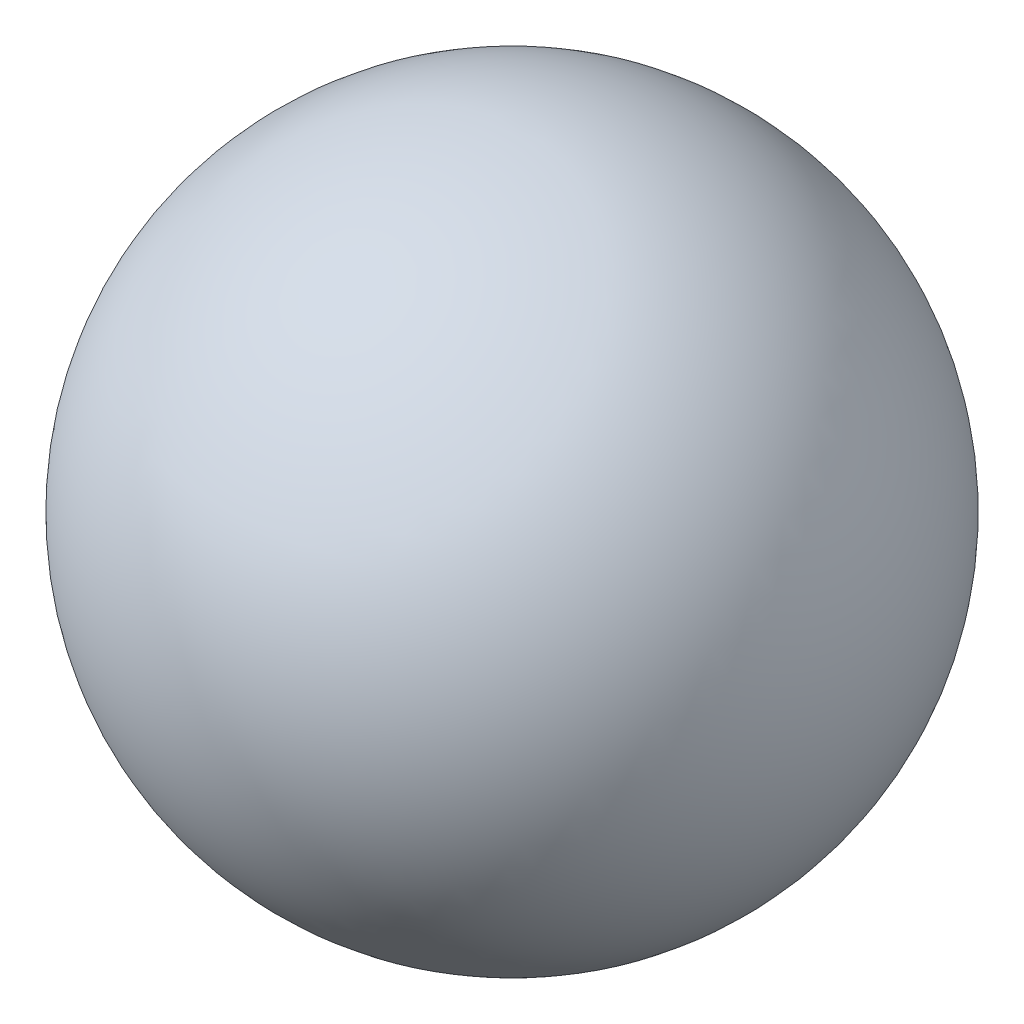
ISO-10303-21;
HEADER;
FILE_DESCRIPTION(('STEP AP214'),'2;1');
FILE_NAME('part.step','',(''),(''),'','','');
FILE_SCHEMA(('AUTOMOTIVE_DESIGN { 1 0 10303 214 1 1 1 1 }'));
ENDSEC;
DATA;
#1=APPLICATION_CONTEXT('core data for automotive mechanical design processes');
#2=APPLICATION_PROTOCOL_DEFINITION('international standard','automotive_design',2000,#1);
#3=PRODUCT_CONTEXT('',#1,'mechanical');
#4=PRODUCT('Part','Part','',(#3));
#5=PRODUCT_RELATED_PRODUCT_CATEGORY('part','',(#4));
#6=PRODUCT_DEFINITION_FORMATION('','',#4);
#7=PRODUCT_DEFINITION_CONTEXT('part definition',#1,'design');
#8=PRODUCT_DEFINITION('design','',#6,#7);
#9=PRODUCT_DEFINITION_SHAPE('','',#8);
#10=(LENGTH_UNIT() NAMED_UNIT(*) SI_UNIT(.MILLI.,.METRE.));
#11=(NAMED_UNIT(*) PLANE_ANGLE_UNIT() SI_UNIT($,.RADIAN.));
#12=(NAMED_UNIT(*) SI_UNIT($,.STERADIAN.) SOLID_ANGLE_UNIT());
#13=UNCERTAINTY_MEASURE_WITH_UNIT(LENGTH_MEASURE(1.E-05),#10,'distance_accuracy_value','');
#14=(GEOMETRIC_REPRESENTATION_CONTEXT(3) GLOBAL_UNCERTAINTY_ASSIGNED_CONTEXT((#13)) GLOBAL_UNIT_ASSIGNED_CONTEXT((#10,
#11,#12)) REPRESENTATION_CONTEXT('',''));
#15=CARTESIAN_POINT('',(0.,0.,0.));
#16=DIRECTION('',(0.,0.,1.));
#17=DIRECTION('',(1.,0.,0.));
#18=AXIS2_PLACEMENT_3D('',#15,#16,#17);
#19=CARTESIAN_POINT('',(0.,-6.75577510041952,0.));
#20=DIRECTION('',(0.,1.,0.));
#21=DIRECTION('',(-1.,0.,0.));
#22=AXIS2_PLACEMENT_3D('',#19,#20,#21);
#23=SPHERICAL_SURFACE('',#22,20.);
#24=CARTESIAN_POINT('',(0.,13.2442248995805,0.));
#25=VERTEX_POINT('',#24);
#26=VERTEX_LOOP('',#25);
#27=FACE_BOUND('',#26,.T.);
#28=ADVANCED_FACE('F30',(#27),#23,.T.);
#29=CLOSED_SHELL('',(#28));
#30=CARTESIAN_POINT('',(0.,-6.75577510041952,0.));
#31=DIRECTION('',(0.,1.,0.));
#32=DIRECTION('',(-1.,0.,0.));
#33=AXIS2_PLACEMENT_3D('',#30,#31,#32);
#34=SPHERICAL_SURFACE('',#33,10.);
#35=CARTESIAN_POINT('',(0.,3.24422489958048,0.));
#36=VERTEX_POINT('',#35);
#37=VERTEX_LOOP('',#36);
#38=FACE_BOUND('',#37,.T.);
#39=ADVANCED_FACE('F32',(#38),#34,.F.);
#40=CLOSED_SHELL('',(#39));
#41=ORIENTED_CLOSED_SHELL('',*,#40,.T.);
#42=BREP_WITH_VOIDS('B2',#29,(#41));
#43=ADVANCED_BREP_SHAPE_REPRESENTATION('',(#18,#42),#14);
#44=SHAPE_DEFINITION_REPRESENTATION(#9,#43);
ENDSEC;
END-ISO-10303-21;
